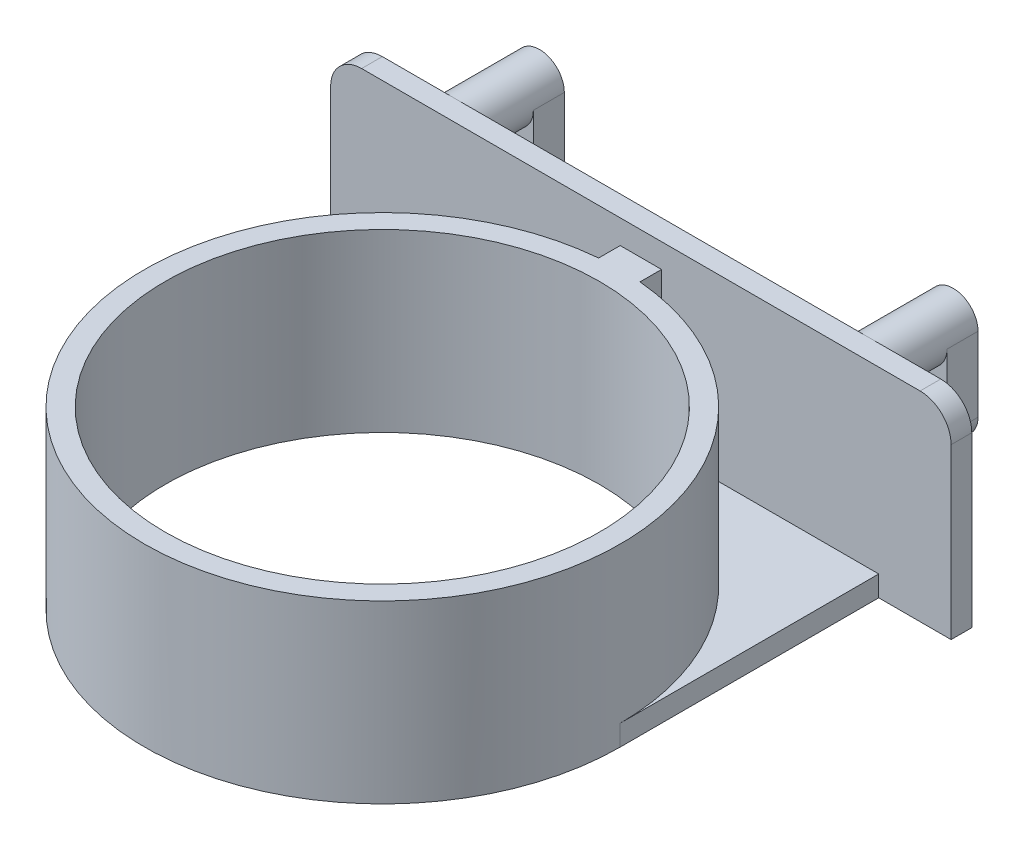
ISO-10303-21;
HEADER;
FILE_DESCRIPTION(('STEP AP214'),'2;1');
FILE_NAME('part.step','',(''),(''),'','','');
FILE_SCHEMA(('AUTOMOTIVE_DESIGN { 1 0 10303 214 1 1 1 1 }'));
ENDSEC;
DATA;
#1=APPLICATION_CONTEXT('core data for automotive mechanical design processes');
#2=APPLICATION_PROTOCOL_DEFINITION('international standard','automotive_design',2000,#1);
#3=PRODUCT_CONTEXT('',#1,'mechanical');
#4=PRODUCT('Part','Part','',(#3));
#5=PRODUCT_RELATED_PRODUCT_CATEGORY('part','',(#4));
#6=PRODUCT_DEFINITION_FORMATION('','',#4);
#7=PRODUCT_DEFINITION_CONTEXT('part definition',#1,'design');
#8=PRODUCT_DEFINITION('design','',#6,#7);
#9=PRODUCT_DEFINITION_SHAPE('','',#8);
#10=(LENGTH_UNIT() NAMED_UNIT(*) SI_UNIT(.MILLI.,.METRE.));
#11=(NAMED_UNIT(*) PLANE_ANGLE_UNIT() SI_UNIT($,.RADIAN.));
#12=(NAMED_UNIT(*) SI_UNIT($,.STERADIAN.) SOLID_ANGLE_UNIT());
#13=UNCERTAINTY_MEASURE_WITH_UNIT(LENGTH_MEASURE(1.E-05),#10,'distance_accuracy_value','');
#14=(GEOMETRIC_REPRESENTATION_CONTEXT(3) GLOBAL_UNCERTAINTY_ASSIGNED_CONTEXT((#13)) GLOBAL_UNIT_ASSIGNED_CONTEXT((#10,
#11,#12)) REPRESENTATION_CONTEXT('',''));
#15=CARTESIAN_POINT('',(0.,0.,0.));
#16=DIRECTION('',(0.,0.,1.));
#17=DIRECTION('',(1.,0.,0.));
#18=AXIS2_PLACEMENT_3D('',#15,#16,#17);
#19=CARTESIAN_POINT('',(0.,0.,0.));
#20=DIRECTION('',(0.,-1.,0.));
#21=DIRECTION('',(0.,0.,-1.));
#22=AXIS2_PLACEMENT_3D('',#19,#20,#21);
#23=PLANE('',#22);
#24=CARTESIAN_POINT('',(0.,0.,0.));
#25=DIRECTION('',(0.,1.,0.));
#26=DIRECTION('',(0.,0.,1.));
#27=AXIS2_PLACEMENT_3D('',#24,#25,#26);
#28=CIRCLE('',#27,23.);
#29=CARTESIAN_POINT('',(-2.,0.,-22.9128784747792));
#30=VERTEX_POINT('',#29);
#31=CARTESIAN_POINT('',(-23.,0.,0.));
#32=VERTEX_POINT('',#31);
#33=EDGE_CURVE('E360',#30,#32,#28,.T.);
#34=ORIENTED_EDGE('',*,*,#33,.F.);
#35=DIRECTION('',(0.,0.,1.));
#36=VECTOR('',#35,1.);
#37=CARTESIAN_POINT('',(-2.,0.,-21.8));
#38=LINE('',#37,#36);
#39=CARTESIAN_POINT('',(-2.,0.,-25.));
#40=VERTEX_POINT('',#39);
#41=EDGE_CURVE('E269',#40,#30,#38,.T.);
#42=ORIENTED_EDGE('',*,*,#41,.F.);
#43=DIRECTION('',(1.,0.,0.));
#44=VECTOR('',#43,1.);
#45=CARTESIAN_POINT('',(23.,0.,-25.));
#46=LINE('',#45,#44);
#47=CARTESIAN_POINT('',(-23.,0.,-25.));
#48=VERTEX_POINT('',#47);
#49=EDGE_CURVE('E342',#48,#40,#46,.T.);
#50=ORIENTED_EDGE('',*,*,#49,.F.);
#51=DIRECTION('',(0.,0.,-1.));
#52=VECTOR('',#51,1.);
#53=CARTESIAN_POINT('',(-23.,0.,0.));
#54=LINE('',#53,#52);
#55=EDGE_CURVE('E329',#32,#48,#54,.T.);
#56=ORIENTED_EDGE('',*,*,#55,.F.);
#57=EDGE_LOOP('',(#34,#42,#50,#56));
#58=FACE_BOUND('',#57,.T.);
#59=ADVANCED_FACE('F33',(#58),#23,.F.);
#60=CARTESIAN_POINT('',(0.,15.,0.));
#61=DIRECTION('',(0.,1.,0.));
#62=DIRECTION('',(0.,0.,1.));
#63=AXIS2_PLACEMENT_3D('',#60,#61,#62);
#64=PLANE('',#63);
#65=DIRECTION('',(0.,0.,1.));
#66=VECTOR('',#65,1.);
#67=CARTESIAN_POINT('',(-2.,15.,-21.8));
#68=LINE('',#67,#66);
#69=CARTESIAN_POINT('',(-2.,15.,-25.));
#70=VERTEX_POINT('',#69);
#71=CARTESIAN_POINT('',(-2.,15.,-22.9128784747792));
#72=VERTEX_POINT('',#71);
#73=EDGE_CURVE('E263',#70,#72,#68,.T.);
#74=ORIENTED_EDGE('',*,*,#73,.T.);
#75=CARTESIAN_POINT('',(0.,15.,0.));
#76=DIRECTION('',(0.,1.,0.));
#77=DIRECTION('',(0.,0.,1.));
#78=AXIS2_PLACEMENT_3D('',#75,#76,#77);
#79=CIRCLE('',#78,23.);
#80=CARTESIAN_POINT('',(2.,15.,-22.9128784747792));
#81=VERTEX_POINT('',#80);
#82=EDGE_CURVE('E361',#72,#81,#79,.T.);
#83=ORIENTED_EDGE('',*,*,#82,.T.);
#84=DIRECTION('',(0.,0.,-1.));
#85=VECTOR('',#84,1.);
#86=CARTESIAN_POINT('',(2.,15.,-21.8));
#87=LINE('',#86,#85);
#88=CARTESIAN_POINT('',(2.,15.,-25.));
#89=VERTEX_POINT('',#88);
#90=EDGE_CURVE('E266',#81,#89,#87,.T.);
#91=ORIENTED_EDGE('',*,*,#90,.T.);
#92=DIRECTION('',(1.,0.,0.));
#93=VECTOR('',#92,1.);
#94=CARTESIAN_POINT('',(-27.,15.,-25.));
#95=LINE('',#94,#93);
#96=EDGE_CURVE('E41',#70,#89,#95,.T.);
#97=ORIENTED_EDGE('',*,*,#96,.F.);
#98=EDGE_LOOP('',(#74,#83,#91,#97));
#99=FACE_BOUND('',#98,.T.);
#100=CARTESIAN_POINT('',(0.,15.,0.));
#101=DIRECTION('',(0.,1.,0.));
#102=DIRECTION('',(0.,0.,1.));
#103=AXIS2_PLACEMENT_3D('',#100,#101,#102);
#104=CIRCLE('',#103,21.);
#105=CARTESIAN_POINT('',(0.,15.,21.));
#106=VERTEX_POINT('',#105);
#107=EDGE_CURVE('E357',#106,#106,#104,.T.);
#108=ORIENTED_EDGE('',*,*,#107,.F.);
#109=EDGE_LOOP('',(#108));
#110=FACE_BOUND('',#109,.T.);
#111=ADVANCED_FACE('F375',(#99,#110),#64,.T.);
#112=CARTESIAN_POINT('',(0.,15.,0.));
#113=DIRECTION('',(0.,-1.,0.));
#114=DIRECTION('',(0.,0.,-1.));
#115=AXIS2_PLACEMENT_3D('',#112,#113,#114);
#116=CYLINDRICAL_SURFACE('',#115,23.);
#117=ORIENTED_EDGE('',*,*,#82,.F.);
#118=DIRECTION('',(0.,-1.,0.));
#119=VECTOR('',#118,1.);
#120=CARTESIAN_POINT('',(-2.,15.,-22.9128784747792));
#121=LINE('',#120,#119);
#122=EDGE_CURVE('E278',#72,#30,#121,.T.);
#123=ORIENTED_EDGE('',*,*,#122,.T.);
#124=ORIENTED_EDGE('',*,*,#33,.T.);
#125=DIRECTION('',(0.,1.,0.));
#126=VECTOR('',#125,1.);
#127=CARTESIAN_POINT('',(-23.,-2.,0.));
#128=LINE('',#127,#126);
#129=CARTESIAN_POINT('',(-23.,-2.,0.));
#130=VERTEX_POINT('',#129);
#131=EDGE_CURVE('E354',#130,#32,#128,.T.);
#132=ORIENTED_EDGE('',*,*,#131,.F.);
#133=CARTESIAN_POINT('',(0.,-2.,0.));
#134=DIRECTION('',(0.,-1.,0.));
#135=DIRECTION('',(0.,0.,-1.));
#136=AXIS2_PLACEMENT_3D('',#133,#134,#135);
#137=CIRCLE('',#136,23.);
#138=CARTESIAN_POINT('',(23.,-2.,0.));
#139=VERTEX_POINT('',#138);
#140=EDGE_CURVE('E330',#139,#130,#137,.T.);
#141=ORIENTED_EDGE('',*,*,#140,.F.);
#142=DIRECTION('',(0.,1.,0.));
#143=VECTOR('',#142,1.);
#144=CARTESIAN_POINT('',(23.,-2.,0.));
#145=LINE('',#144,#143);
#146=CARTESIAN_POINT('',(23.,0.,0.));
#147=VERTEX_POINT('',#146);
#148=EDGE_CURVE('E338',#139,#147,#145,.T.);
#149=ORIENTED_EDGE('',*,*,#148,.T.);
#150=CARTESIAN_POINT('',(2.,0.,-22.9128784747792));
#151=VERTEX_POINT('',#150);
#152=EDGE_CURVE('E365',#147,#151,#28,.T.);
#153=ORIENTED_EDGE('',*,*,#152,.T.);
#154=DIRECTION('',(0.,-1.,0.));
#155=VECTOR('',#154,1.);
#156=CARTESIAN_POINT('',(2.,15.,-22.9128784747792));
#157=LINE('',#156,#155);
#158=EDGE_CURVE('E275',#151,#81,#157,.F.);
#159=ORIENTED_EDGE('',*,*,#158,.T.);
#160=EDGE_LOOP('',(#117,#123,#124,#132,#141,#149,#153,#159));
#161=FACE_BOUND('',#160,.T.);
#162=ADVANCED_FACE('F35',(#161),#116,.T.);
#163=CARTESIAN_POINT('',(0.,15.,0.));
#164=DIRECTION('',(0.,-1.,0.));
#165=DIRECTION('',(0.,0.,-1.));
#166=AXIS2_PLACEMENT_3D('',#163,#164,#165);
#167=CYLINDRICAL_SURFACE('',#166,21.);
#168=ORIENTED_EDGE('',*,*,#107,.T.);
#169=EDGE_LOOP('',(#168));
#170=FACE_BOUND('',#169,.T.);
#171=CARTESIAN_POINT('',(0.,-2.,0.));
#172=DIRECTION('',(0.,-1.,0.));
#173=DIRECTION('',(0.,0.,-1.));
#174=AXIS2_PLACEMENT_3D('',#171,#172,#173);
#175=CIRCLE('',#174,21.);
#176=CARTESIAN_POINT('',(0.,-2.,-21.));
#177=VERTEX_POINT('',#176);
#178=EDGE_CURVE('E223',#177,#177,#175,.F.);
#179=ORIENTED_EDGE('',*,*,#178,.F.);
#180=EDGE_LOOP('',(#179));
#181=FACE_BOUND('',#180,.T.);
#182=ADVANCED_FACE('F596',(#170,#181),#167,.F.);
#183=CARTESIAN_POINT('',(-23.,-2.,0.));
#184=DIRECTION('',(1.,0.,0.));
#185=DIRECTION('',(0.,0.,-1.));
#186=AXIS2_PLACEMENT_3D('',#183,#184,#185);
#187=PLANE('',#186);
#188=ORIENTED_EDGE('',*,*,#55,.T.);
#189=DIRECTION('',(0.,1.,0.));
#190=VECTOR('',#189,1.);
#191=CARTESIAN_POINT('',(-23.,-2.,-25.));
#192=LINE('',#191,#190);
#193=CARTESIAN_POINT('',(-23.,-2.,-25.));
#194=VERTEX_POINT('',#193);
#195=EDGE_CURVE('E351',#194,#48,#192,.T.);
#196=ORIENTED_EDGE('',*,*,#195,.F.);
#197=DIRECTION('',(0.,0.,-1.));
#198=VECTOR('',#197,1.);
#199=CARTESIAN_POINT('',(-23.,-2.,0.));
#200=LINE('',#199,#198);
#201=EDGE_CURVE('E333',#130,#194,#200,.T.);
#202=ORIENTED_EDGE('',*,*,#201,.F.);
#203=ORIENTED_EDGE('',*,*,#131,.T.);
#204=EDGE_LOOP('',(#188,#196,#202,#203));
#205=FACE_BOUND('',#204,.T.);
#206=ADVANCED_FACE('F388',(#205),#187,.F.);
#207=CARTESIAN_POINT('',(23.,-2.,0.));
#208=DIRECTION('',(-1.,0.,0.));
#209=DIRECTION('',(0.,0.,1.));
#210=AXIS2_PLACEMENT_3D('',#207,#208,#209);
#211=PLANE('',#210);
#212=DIRECTION('',(0.,0.,1.));
#213=VECTOR('',#212,1.);
#214=CARTESIAN_POINT('',(23.,0.,0.));
#215=LINE('',#214,#213);
#216=CARTESIAN_POINT('',(23.,0.,-25.));
#217=VERTEX_POINT('',#216);
#218=EDGE_CURVE('E334',#217,#147,#215,.T.);
#219=ORIENTED_EDGE('',*,*,#218,.T.);
#220=ORIENTED_EDGE('',*,*,#148,.F.);
#221=DIRECTION('',(0.,0.,1.));
#222=VECTOR('',#221,1.);
#223=CARTESIAN_POINT('',(23.,-2.,0.));
#224=LINE('',#223,#222);
#225=CARTESIAN_POINT('',(23.,-2.,-25.));
#226=VERTEX_POINT('',#225);
#227=EDGE_CURVE('E336',#226,#139,#224,.T.);
#228=ORIENTED_EDGE('',*,*,#227,.F.);
#229=DIRECTION('',(0.,1.,0.));
#230=VECTOR('',#229,1.);
#231=CARTESIAN_POINT('',(23.,-2.,-25.));
#232=LINE('',#231,#230);
#233=EDGE_CURVE('E348',#226,#217,#232,.T.);
#234=ORIENTED_EDGE('',*,*,#233,.T.);
#235=EDGE_LOOP('',(#219,#220,#228,#234));
#236=FACE_BOUND('',#235,.T.);
#237=ADVANCED_FACE('F396',(#236),#211,.F.);
#238=CARTESIAN_POINT('',(0.,-2.,0.));
#239=DIRECTION('',(0.,-1.,0.));
#240=DIRECTION('',(0.,0.,-1.));
#241=AXIS2_PLACEMENT_3D('',#238,#239,#240);
#242=PLANE('',#241);
#243=ORIENTED_EDGE('',*,*,#178,.T.);
#244=EDGE_LOOP('',(#243));
#245=FACE_BOUND('',#244,.T.);
#246=ORIENTED_EDGE('',*,*,#140,.T.);
#247=ORIENTED_EDGE('',*,*,#201,.T.);
#248=DIRECTION('',(-1.,0.,0.));
#249=VECTOR('',#248,1.);
#250=CARTESIAN_POINT('',(30.,-1.99999999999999,-25.));
#251=LINE('',#250,#249);
#252=CARTESIAN_POINT('',(-30.,-1.99999999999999,-25.));
#253=VERTEX_POINT('',#252);
#254=EDGE_CURVE('E307',#194,#253,#251,.T.);
#255=ORIENTED_EDGE('',*,*,#254,.T.);
#256=DIRECTION('',(0.,0.,1.));
#257=VECTOR('',#256,1.);
#258=CARTESIAN_POINT('',(-30.,-1.99999999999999,-27.));
#259=LINE('',#258,#257);
#260=CARTESIAN_POINT('',(-30.,-1.99999999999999,-27.));
#261=VERTEX_POINT('',#260);
#262=EDGE_CURVE('E314',#261,#253,#259,.T.);
#263=ORIENTED_EDGE('',*,*,#262,.F.);
#264=DIRECTION('',(-1.,0.,0.));
#265=VECTOR('',#264,1.);
#266=CARTESIAN_POINT('',(30.,-1.99999999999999,-27.));
#267=LINE('',#266,#265);
#268=CARTESIAN_POINT('',(30.,-1.99999999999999,-27.));
#269=VERTEX_POINT('',#268);
#270=EDGE_CURVE('E294',#269,#261,#267,.T.);
#271=ORIENTED_EDGE('',*,*,#270,.F.);
#272=DIRECTION('',(0.,0.,1.));
#273=VECTOR('',#272,1.);
#274=CARTESIAN_POINT('',(30.,-1.99999999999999,-27.));
#275=LINE('',#274,#273);
#276=CARTESIAN_POINT('',(30.,-1.99999999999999,-25.));
#277=VERTEX_POINT('',#276);
#278=EDGE_CURVE('E317',#269,#277,#275,.T.);
#279=ORIENTED_EDGE('',*,*,#278,.T.);
#280=EDGE_CURVE('E308',#277,#226,#251,.T.);
#281=ORIENTED_EDGE('',*,*,#280,.T.);
#282=ORIENTED_EDGE('',*,*,#227,.T.);
#283=EDGE_LOOP('',(#246,#247,#255,#263,#271,#279,#281,#282));
#284=FACE_BOUND('',#283,.T.);
#285=ADVANCED_FACE('F392',(#245,#284),#242,.T.);
#286=CARTESIAN_POINT('',(2.,0.,-25.));
#287=VERTEX_POINT('',#286);
#288=EDGE_CURVE('E341',#287,#217,#46,.T.);
#289=ORIENTED_EDGE('',*,*,#288,.F.);
#290=DIRECTION('',(0.,0.,-1.));
#291=VECTOR('',#290,1.);
#292=CARTESIAN_POINT('',(2.,0.,-21.8));
#293=LINE('',#292,#291);
#294=EDGE_CURVE('E273',#151,#287,#293,.T.);
#295=ORIENTED_EDGE('',*,*,#294,.F.);
#296=ORIENTED_EDGE('',*,*,#152,.F.);
#297=ORIENTED_EDGE('',*,*,#218,.F.);
#298=EDGE_LOOP('',(#289,#295,#296,#297));
#299=FACE_BOUND('',#298,.T.);
#300=ADVANCED_FACE('F401',(#299),#23,.F.);
#301=CARTESIAN_POINT('',(-27.,14.3250882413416,-27.));
#302=DIRECTION('',(0.,0.,1.));
#303=DIRECTION('',(1.,0.,0.));
#304=AXIS2_PLACEMENT_3D('',#301,#302,#303);
#305=CYLINDRICAL_SURFACE('',#304,3.);
#306=CARTESIAN_POINT('',(-27.,14.3250882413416,-25.));
#307=DIRECTION('',(0.,0.,-1.));
#308=DIRECTION('',(-1.,0.,0.));
#309=AXIS2_PLACEMENT_3D('',#306,#307,#308);
#310=CIRCLE('',#309,3.);
#311=CARTESIAN_POINT('',(-30.,14.3250882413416,-25.));
#312=VERTEX_POINT('',#311);
#313=CARTESIAN_POINT('',(-27.,17.3250882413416,-25.));
#314=VERTEX_POINT('',#313);
#315=EDGE_CURVE('E281',#312,#314,#310,.T.);
#316=ORIENTED_EDGE('',*,*,#315,.T.);
#317=DIRECTION('',(0.,0.,1.));
#318=VECTOR('',#317,1.);
#319=CARTESIAN_POINT('',(-27.,17.3250882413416,-27.));
#320=LINE('',#319,#318);
#321=CARTESIAN_POINT('',(-27.,17.3250882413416,-27.));
#322=VERTEX_POINT('',#321);
#323=EDGE_CURVE('E326',#322,#314,#320,.T.);
#324=ORIENTED_EDGE('',*,*,#323,.F.);
#325=CARTESIAN_POINT('',(-27.,14.3250882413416,-27.));
#326=DIRECTION('',(0.,0.,-1.));
#327=DIRECTION('',(-1.,0.,0.));
#328=AXIS2_PLACEMENT_3D('',#325,#326,#327);
#329=CIRCLE('',#328,3.);
#330=CARTESIAN_POINT('',(-30.,14.3250882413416,-27.));
#331=VERTEX_POINT('',#330);
#332=EDGE_CURVE('E282',#331,#322,#329,.T.);
#333=ORIENTED_EDGE('',*,*,#332,.F.);
#334=DIRECTION('',(0.,0.,1.));
#335=VECTOR('',#334,1.);
#336=CARTESIAN_POINT('',(-30.,14.3250882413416,-27.));
#337=LINE('',#336,#335);
#338=EDGE_CURVE('E298',#331,#312,#337,.T.);
#339=ORIENTED_EDGE('',*,*,#338,.T.);
#340=EDGE_LOOP('',(#316,#324,#333,#339));
#341=FACE_BOUND('',#340,.T.);
#342=ADVANCED_FACE('F422',(#341),#305,.T.);
#343=CARTESIAN_POINT('',(-27.,17.3250882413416,-27.));
#344=DIRECTION('',(0.,-1.,0.));
#345=DIRECTION('',(1.,0.,0.));
#346=AXIS2_PLACEMENT_3D('',#343,#344,#345);
#347=PLANE('',#346);
#348=DIRECTION('',(1.,0.,0.));
#349=VECTOR('',#348,1.);
#350=CARTESIAN_POINT('',(-27.,17.3250882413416,-25.));
#351=LINE('',#350,#349);
#352=CARTESIAN_POINT('',(27.,17.3250882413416,-25.));
#353=VERTEX_POINT('',#352);
#354=EDGE_CURVE('E301',#314,#353,#351,.T.);
#355=ORIENTED_EDGE('',*,*,#354,.T.);
#356=DIRECTION('',(0.,0.,1.));
#357=VECTOR('',#356,1.);
#358=CARTESIAN_POINT('',(27.,17.3250882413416,-27.));
#359=LINE('',#358,#357);
#360=CARTESIAN_POINT('',(27.,17.3250882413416,-27.));
#361=VERTEX_POINT('',#360);
#362=EDGE_CURVE('E323',#361,#353,#359,.T.);
#363=ORIENTED_EDGE('',*,*,#362,.F.);
#364=DIRECTION('',(1.,0.,0.));
#365=VECTOR('',#364,1.);
#366=CARTESIAN_POINT('',(-27.,17.3250882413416,-27.));
#367=LINE('',#366,#365);
#368=CARTESIAN_POINT('',(20.,17.3250882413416,-27.));
#369=VERTEX_POINT('',#368);
#370=EDGE_CURVE('E285',#369,#361,#367,.T.);
#371=ORIENTED_EDGE('',*,*,#370,.F.);
#372=CARTESIAN_POINT('',(-20.,17.3250882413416,-27.));
#373=VERTEX_POINT('',#372);
#374=EDGE_CURVE('E290',#373,#369,#367,.T.);
#375=ORIENTED_EDGE('',*,*,#374,.F.);
#376=EDGE_CURVE('E287',#322,#373,#367,.T.);
#377=ORIENTED_EDGE('',*,*,#376,.F.);
#378=ORIENTED_EDGE('',*,*,#323,.T.);
#379=EDGE_LOOP('',(#355,#363,#371,#375,#377,#378));
#380=FACE_BOUND('',#379,.T.);
#381=ADVANCED_FACE('F427',(#380),#347,.F.);
#382=CARTESIAN_POINT('',(27.,14.3250882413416,-27.));
#383=DIRECTION('',(0.,0.,1.));
#384=DIRECTION('',(1.,0.,0.));
#385=AXIS2_PLACEMENT_3D('',#382,#383,#384);
#386=CYLINDRICAL_SURFACE('',#385,3.);
#387=CARTESIAN_POINT('',(27.,14.3250882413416,-25.));
#388=DIRECTION('',(0.,0.,-1.));
#389=DIRECTION('',(-1.,0.,0.));
#390=AXIS2_PLACEMENT_3D('',#387,#388,#389);
#391=CIRCLE('',#390,3.);
#392=CARTESIAN_POINT('',(30.,14.3250882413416,-25.));
#393=VERTEX_POINT('',#392);
#394=EDGE_CURVE('E303',#353,#393,#391,.T.);
#395=ORIENTED_EDGE('',*,*,#394,.T.);
#396=DIRECTION('',(0.,0.,1.));
#397=VECTOR('',#396,1.);
#398=CARTESIAN_POINT('',(30.,14.3250882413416,-27.));
#399=LINE('',#398,#397);
#400=CARTESIAN_POINT('',(30.,14.3250882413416,-27.));
#401=VERTEX_POINT('',#400);
#402=EDGE_CURVE('E320',#401,#393,#399,.T.);
#403=ORIENTED_EDGE('',*,*,#402,.F.);
#404=CARTESIAN_POINT('',(27.,14.3250882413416,-27.));
#405=DIRECTION('',(0.,0.,-1.));
#406=DIRECTION('',(-1.,0.,0.));
#407=AXIS2_PLACEMENT_3D('',#404,#405,#406);
#408=CIRCLE('',#407,3.);
#409=EDGE_CURVE('E289',#361,#401,#408,.T.);
#410=ORIENTED_EDGE('',*,*,#409,.F.);
#411=ORIENTED_EDGE('',*,*,#362,.T.);
#412=EDGE_LOOP('',(#395,#403,#410,#411));
#413=FACE_BOUND('',#412,.T.);
#414=ADVANCED_FACE('F438',(#413),#386,.T.);
#415=CARTESIAN_POINT('',(30.,-1.99999999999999,-27.));
#416=DIRECTION('',(-1.,0.,0.));
#417=DIRECTION('',(0.,0.,1.));
#418=AXIS2_PLACEMENT_3D('',#415,#416,#417);
#419=PLANE('',#418);
#420=DIRECTION('',(0.,-1.,0.));
#421=VECTOR('',#420,1.);
#422=CARTESIAN_POINT('',(30.,-1.99999999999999,-25.));
#423=LINE('',#422,#421);
#424=EDGE_CURVE('E305',#393,#277,#423,.T.);
#425=ORIENTED_EDGE('',*,*,#424,.T.);
#426=ORIENTED_EDGE('',*,*,#278,.F.);
#427=DIRECTION('',(0.,-1.,0.));
#428=VECTOR('',#427,1.);
#429=CARTESIAN_POINT('',(30.,-1.99999999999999,-27.));
#430=LINE('',#429,#428);
#431=EDGE_CURVE('E292',#401,#269,#430,.T.);
#432=ORIENTED_EDGE('',*,*,#431,.F.);
#433=ORIENTED_EDGE('',*,*,#402,.T.);
#434=EDGE_LOOP('',(#425,#426,#432,#433));
#435=FACE_BOUND('',#434,.T.);
#436=ADVANCED_FACE('F442',(#435),#419,.F.);
#437=CARTESIAN_POINT('',(-30.,-1.99999999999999,-27.));
#438=DIRECTION('',(1.,0.,0.));
#439=DIRECTION('',(0.,0.,-1.));
#440=AXIS2_PLACEMENT_3D('',#437,#438,#439);
#441=PLANE('',#440);
#442=DIRECTION('',(0.,1.,0.));
#443=VECTOR('',#442,1.);
#444=CARTESIAN_POINT('',(-30.,-1.99999999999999,-25.));
#445=LINE('',#444,#443);
#446=EDGE_CURVE('E286',#253,#312,#445,.T.);
#447=ORIENTED_EDGE('',*,*,#446,.T.);
#448=ORIENTED_EDGE('',*,*,#338,.F.);
#449=DIRECTION('',(0.,1.,0.));
#450=VECTOR('',#449,1.);
#451=CARTESIAN_POINT('',(-30.,-1.99999999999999,-27.));
#452=LINE('',#451,#450);
#453=EDGE_CURVE('E296',#261,#331,#452,.T.);
#454=ORIENTED_EDGE('',*,*,#453,.F.);
#455=ORIENTED_EDGE('',*,*,#262,.T.);
#456=EDGE_LOOP('',(#447,#448,#454,#455));
#457=FACE_BOUND('',#456,.T.);
#458=ADVANCED_FACE('F446',(#457),#441,.F.);
#459=CARTESIAN_POINT('',(-27.,14.3250882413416,-27.));
#460=DIRECTION('',(0.,0.,-1.));
#461=DIRECTION('',(-1.,0.,0.));
#462=AXIS2_PLACEMENT_3D('',#459,#460,#461);
#463=PLANE('',#462);
#464=ORIENTED_EDGE('',*,*,#376,.T.);
#465=CARTESIAN_POINT('',(-20.,14.9250882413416,-27.));
#466=DIRECTION('',(0.,0.,1.));
#467=DIRECTION('',(1.,0.,0.));
#468=AXIS2_PLACEMENT_3D('',#465,#466,#467);
#469=CIRCLE('',#468,2.4);
#470=EDGE_CURVE('E200',#373,#373,#469,.T.);
#471=ORIENTED_EDGE('',*,*,#470,.T.);
#472=ORIENTED_EDGE('',*,*,#374,.T.);
#473=CARTESIAN_POINT('',(20.,14.9250882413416,-27.));
#474=DIRECTION('',(0.,0.,-1.));
#475=DIRECTION('',(-1.,0.,0.));
#476=AXIS2_PLACEMENT_3D('',#473,#474,#475);
#477=CIRCLE('',#476,2.4);
#478=EDGE_CURVE('E261',#369,#369,#477,.T.);
#479=ORIENTED_EDGE('',*,*,#478,.F.);
#480=ORIENTED_EDGE('',*,*,#370,.T.);
#481=ORIENTED_EDGE('',*,*,#409,.T.);
#482=ORIENTED_EDGE('',*,*,#431,.T.);
#483=ORIENTED_EDGE('',*,*,#270,.T.);
#484=ORIENTED_EDGE('',*,*,#453,.T.);
#485=ORIENTED_EDGE('',*,*,#332,.T.);
#486=EDGE_LOOP('',(#464,#471,#472,#479,#480,#481,#482,#483,#484,#485));
#487=FACE_BOUND('',#486,.T.);
#488=ADVANCED_FACE('F450',(#487),#463,.T.);
#489=CARTESIAN_POINT('',(-27.,14.3250882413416,-25.));
#490=DIRECTION('',(0.,0.,-1.));
#491=DIRECTION('',(-1.,0.,0.));
#492=AXIS2_PLACEMENT_3D('',#489,#490,#491);
#493=PLANE('',#492);
#494=ORIENTED_EDGE('',*,*,#49,.T.);
#495=DIRECTION('',(0.,1.,0.));
#496=VECTOR('',#495,1.);
#497=CARTESIAN_POINT('',(-2.,14.3250882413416,-25.));
#498=LINE('',#497,#496);
#499=EDGE_CURVE('E11',#40,#70,#498,.T.);
#500=ORIENTED_EDGE('',*,*,#499,.T.);
#501=ORIENTED_EDGE('',*,*,#96,.T.);
#502=DIRECTION('',(0.,-1.,0.));
#503=VECTOR('',#502,1.);
#504=CARTESIAN_POINT('',(2.,14.3250882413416,-25.));
#505=LINE('',#504,#503);
#506=EDGE_CURVE('E364',#89,#287,#505,.T.);
#507=ORIENTED_EDGE('',*,*,#506,.T.);
#508=ORIENTED_EDGE('',*,*,#288,.T.);
#509=ORIENTED_EDGE('',*,*,#233,.F.);
#510=ORIENTED_EDGE('',*,*,#280,.F.);
#511=ORIENTED_EDGE('',*,*,#424,.F.);
#512=ORIENTED_EDGE('',*,*,#394,.F.);
#513=ORIENTED_EDGE('',*,*,#354,.F.);
#514=ORIENTED_EDGE('',*,*,#315,.F.);
#515=ORIENTED_EDGE('',*,*,#446,.F.);
#516=ORIENTED_EDGE('',*,*,#254,.F.);
#517=ORIENTED_EDGE('',*,*,#195,.T.);
#518=EDGE_LOOP('',(#494,#500,#501,#507,#508,#509,#510,#511,#512,#513,#514,#515,#516,#517));
#519=FACE_BOUND('',#518,.T.);
#520=ADVANCED_FACE('F371',(#519),#493,.F.);
#521=CARTESIAN_POINT('',(-2.,-6.40312423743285,-21.8));
#522=DIRECTION('',(-1.,0.,0.));
#523=DIRECTION('',(0.,0.,1.));
#524=AXIS2_PLACEMENT_3D('',#521,#522,#523);
#525=PLANE('',#524);
#526=ORIENTED_EDGE('',*,*,#122,.F.);
#527=ORIENTED_EDGE('',*,*,#73,.F.);
#528=ORIENTED_EDGE('',*,*,#499,.F.);
#529=ORIENTED_EDGE('',*,*,#41,.T.);
#530=EDGE_LOOP('',(#526,#527,#528,#529));
#531=FACE_BOUND('',#530,.T.);
#532=ADVANCED_FACE('F379',(#531),#525,.T.);
#533=CARTESIAN_POINT('',(2.,-6.40312423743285,-21.8));
#534=DIRECTION('',(1.,0.,0.));
#535=DIRECTION('',(0.,0.,-1.));
#536=AXIS2_PLACEMENT_3D('',#533,#534,#535);
#537=PLANE('',#536);
#538=ORIENTED_EDGE('',*,*,#158,.F.);
#539=ORIENTED_EDGE('',*,*,#294,.T.);
#540=ORIENTED_EDGE('',*,*,#506,.F.);
#541=ORIENTED_EDGE('',*,*,#90,.F.);
#542=EDGE_LOOP('',(#538,#539,#540,#541));
#543=FACE_BOUND('',#542,.T.);
#544=ADVANCED_FACE('F403',(#543),#537,.T.);
#545=CARTESIAN_POINT('',(20.,14.9250882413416,-32.2));
#546=DIRECTION('',(0.,0.,1.));
#547=DIRECTION('',(1.,0.,0.));
#548=AXIS2_PLACEMENT_3D('',#545,#546,#547);
#549=CYLINDRICAL_SURFACE('',#548,2.4);
#550=CARTESIAN_POINT('',(20.,14.9250882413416,-32.2));
#551=DIRECTION('',(0.,0.,-1.));
#552=DIRECTION('',(-1.,0.,0.));
#553=AXIS2_PLACEMENT_3D('',#550,#551,#552);
#554=CIRCLE('',#553,2.4);
#555=CARTESIAN_POINT('',(22.4,14.9250882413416,-32.2));
#556=VERTEX_POINT('',#555);
#557=CARTESIAN_POINT('',(17.6,14.9250882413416,-32.2));
#558=VERTEX_POINT('',#557);
#559=EDGE_CURVE('E56',#556,#558,#554,.T.);
#560=ORIENTED_EDGE('',*,*,#559,.F.);
#561=DIRECTION('',(0.,0.,1.));
#562=VECTOR('',#561,1.);
#563=CARTESIAN_POINT('',(22.4,14.9250882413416,-35.2));
#564=LINE('',#563,#562);
#565=CARTESIAN_POINT('',(22.4,14.9250882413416,-35.2));
#566=VERTEX_POINT('',#565);
#567=EDGE_CURVE('E258',#566,#556,#564,.T.);
#568=ORIENTED_EDGE('',*,*,#567,.F.);
#569=CARTESIAN_POINT('',(20.,14.9250882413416,-35.2));
#570=DIRECTION('',(0.,0.,-1.));
#571=DIRECTION('',(-1.,0.,0.));
#572=AXIS2_PLACEMENT_3D('',#569,#570,#571);
#573=CIRCLE('',#572,2.4);
#574=CARTESIAN_POINT('',(17.6,14.9250882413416,-35.2));
#575=VERTEX_POINT('',#574);
#576=EDGE_CURVE('E235',#575,#566,#573,.T.);
#577=ORIENTED_EDGE('',*,*,#576,.F.);
#578=DIRECTION('',(0.,0.,1.));
#579=VECTOR('',#578,1.);
#580=CARTESIAN_POINT('',(17.6,14.9250882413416,-35.2));
#581=LINE('',#580,#579);
#582=EDGE_CURVE('E245',#575,#558,#581,.T.);
#583=ORIENTED_EDGE('',*,*,#582,.T.);
#584=EDGE_LOOP('',(#560,#568,#577,#583));
#585=FACE_BOUND('',#584,.T.);
#586=ORIENTED_EDGE('',*,*,#478,.T.);
#587=EDGE_LOOP('',(#586));
#588=FACE_BOUND('',#587,.T.);
#589=ADVANCED_FACE('F405',(#585,#588),#549,.T.);
#590=CARTESIAN_POINT('',(20.,14.9250882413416,-32.2));
#591=DIRECTION('',(0.,0.,-1.));
#592=DIRECTION('',(-1.,0.,0.));
#593=AXIS2_PLACEMENT_3D('',#590,#591,#592);
#594=PLANE('',#593);
#595=DIRECTION('',(0.,-1.,0.));
#596=VECTOR('',#595,1.);
#597=CARTESIAN_POINT('',(22.4,14.9250882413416,-32.2));
#598=LINE('',#597,#596);
#599=CARTESIAN_POINT('',(22.4,7.72508824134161,-32.2));
#600=VERTEX_POINT('',#599);
#601=EDGE_CURVE('E232',#556,#600,#598,.T.);
#602=ORIENTED_EDGE('',*,*,#601,.F.);
#603=ORIENTED_EDGE('',*,*,#559,.T.);
#604=DIRECTION('',(0.,1.,0.));
#605=VECTOR('',#604,1.);
#606=CARTESIAN_POINT('',(17.6,14.9250882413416,-32.2));
#607=LINE('',#606,#605);
#608=CARTESIAN_POINT('',(17.6,7.72508824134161,-32.2));
#609=VERTEX_POINT('',#608);
#610=EDGE_CURVE('E239',#609,#558,#607,.T.);
#611=ORIENTED_EDGE('',*,*,#610,.F.);
#612=CARTESIAN_POINT('',(20.,7.72508824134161,-32.2));
#613=DIRECTION('',(0.,0.,-1.));
#614=DIRECTION('',(-1.,0.,0.));
#615=AXIS2_PLACEMENT_3D('',#612,#613,#614);
#616=CIRCLE('',#615,2.39999999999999);
#617=EDGE_CURVE('E247',#600,#609,#616,.T.);
#618=ORIENTED_EDGE('',*,*,#617,.F.);
#619=EDGE_LOOP('',(#602,#603,#611,#618));
#620=FACE_BOUND('',#619,.T.);
#621=ADVANCED_FACE('F411',(#620),#594,.F.);
#622=CARTESIAN_POINT('',(22.4,14.9250882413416,-35.2));
#623=DIRECTION('',(-1.,0.,0.));
#624=DIRECTION('',(0.,-1.,0.));
#625=AXIS2_PLACEMENT_3D('',#622,#623,#624);
#626=PLANE('',#625);
#627=ORIENTED_EDGE('',*,*,#601,.T.);
#628=DIRECTION('',(0.,0.,1.));
#629=VECTOR('',#628,1.);
#630=CARTESIAN_POINT('',(22.4,7.72508824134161,-35.2));
#631=LINE('',#630,#629);
#632=CARTESIAN_POINT('',(22.4,7.72508824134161,-35.2));
#633=VERTEX_POINT('',#632);
#634=EDGE_CURVE('E255',#633,#600,#631,.T.);
#635=ORIENTED_EDGE('',*,*,#634,.F.);
#636=DIRECTION('',(0.,-1.,0.));
#637=VECTOR('',#636,1.);
#638=CARTESIAN_POINT('',(22.4,14.9250882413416,-35.2));
#639=LINE('',#638,#637);
#640=EDGE_CURVE('E238',#566,#633,#639,.T.);
#641=ORIENTED_EDGE('',*,*,#640,.F.);
#642=ORIENTED_EDGE('',*,*,#567,.T.);
#643=EDGE_LOOP('',(#627,#635,#641,#642));
#644=FACE_BOUND('',#643,.T.);
#645=ADVANCED_FACE('F495',(#644),#626,.F.);
#646=CARTESIAN_POINT('',(20.,7.72508824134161,-35.2));
#647=DIRECTION('',(0.,0.,1.));
#648=DIRECTION('',(1.,0.,0.));
#649=AXIS2_PLACEMENT_3D('',#646,#647,#648);
#650=CYLINDRICAL_SURFACE('',#649,2.39999999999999);
#651=ORIENTED_EDGE('',*,*,#617,.T.);
#652=DIRECTION('',(0.,0.,1.));
#653=VECTOR('',#652,1.);
#654=CARTESIAN_POINT('',(17.6,7.72508824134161,-35.2));
#655=LINE('',#654,#653);
#656=CARTESIAN_POINT('',(17.6,7.72508824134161,-35.2));
#657=VERTEX_POINT('',#656);
#658=EDGE_CURVE('E252',#657,#609,#655,.T.);
#659=ORIENTED_EDGE('',*,*,#658,.F.);
#660=CARTESIAN_POINT('',(20.,7.72508824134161,-35.2));
#661=DIRECTION('',(0.,0.,-1.));
#662=DIRECTION('',(-1.,0.,0.));
#663=AXIS2_PLACEMENT_3D('',#660,#661,#662);
#664=CIRCLE('',#663,2.39999999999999);
#665=EDGE_CURVE('E241',#633,#657,#664,.T.);
#666=ORIENTED_EDGE('',*,*,#665,.F.);
#667=ORIENTED_EDGE('',*,*,#634,.T.);
#668=EDGE_LOOP('',(#651,#659,#666,#667));
#669=FACE_BOUND('',#668,.T.);
#670=ADVANCED_FACE('F499',(#669),#650,.T.);
#671=CARTESIAN_POINT('',(17.6,14.9250882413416,-35.2));
#672=DIRECTION('',(1.,0.,0.));
#673=DIRECTION('',(0.,1.,0.));
#674=AXIS2_PLACEMENT_3D('',#671,#672,#673);
#675=PLANE('',#674);
#676=ORIENTED_EDGE('',*,*,#610,.T.);
#677=ORIENTED_EDGE('',*,*,#582,.F.);
#678=DIRECTION('',(0.,1.,0.));
#679=VECTOR('',#678,1.);
#680=CARTESIAN_POINT('',(17.6,14.9250882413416,-35.2));
#681=LINE('',#680,#679);
#682=EDGE_CURVE('E243',#657,#575,#681,.T.);
#683=ORIENTED_EDGE('',*,*,#682,.F.);
#684=ORIENTED_EDGE('',*,*,#658,.T.);
#685=EDGE_LOOP('',(#676,#677,#683,#684));
#686=FACE_BOUND('',#685,.T.);
#687=ADVANCED_FACE('F488',(#686),#675,.F.);
#688=CARTESIAN_POINT('',(20.,14.9250882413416,-35.2));
#689=DIRECTION('',(0.,0.,-1.));
#690=DIRECTION('',(-1.,0.,0.));
#691=AXIS2_PLACEMENT_3D('',#688,#689,#690);
#692=PLANE('',#691);
#693=ORIENTED_EDGE('',*,*,#576,.T.);
#694=ORIENTED_EDGE('',*,*,#640,.T.);
#695=ORIENTED_EDGE('',*,*,#665,.T.);
#696=ORIENTED_EDGE('',*,*,#682,.T.);
#697=EDGE_LOOP('',(#693,#694,#695,#696));
#698=FACE_BOUND('',#697,.T.);
#699=ADVANCED_FACE('F480',(#698),#692,.T.);
#700=CARTESIAN_POINT('',(-20.,14.9250882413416,-32.2));
#701=DIRECTION('',(0.,0.,1.));
#702=DIRECTION('',(1.,0.,0.));
#703=AXIS2_PLACEMENT_3D('',#700,#701,#702);
#704=CYLINDRICAL_SURFACE('',#703,2.4);
#705=CARTESIAN_POINT('',(-20.,14.9250882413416,-32.2));
#706=DIRECTION('',(0.,0.,1.));
#707=DIRECTION('',(1.,0.,0.));
#708=AXIS2_PLACEMENT_3D('',#705,#706,#707);
#709=CIRCLE('',#708,2.4);
#710=CARTESIAN_POINT('',(-22.4,14.9250882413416,-32.2));
#711=VERTEX_POINT('',#710);
#712=CARTESIAN_POINT('',(-17.6,14.9250882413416,-32.2));
#713=VERTEX_POINT('',#712);
#714=EDGE_CURVE('E197',#711,#713,#709,.T.);
#715=ORIENTED_EDGE('',*,*,#714,.T.);
#716=DIRECTION('',(0.,0.,1.));
#717=VECTOR('',#716,1.);
#718=CARTESIAN_POINT('',(-17.6,14.9250882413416,-35.2));
#719=LINE('',#718,#717);
#720=CARTESIAN_POINT('',(-17.6,14.9250882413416,-35.2));
#721=VERTEX_POINT('',#720);
#722=EDGE_CURVE('E190',#721,#713,#719,.T.);
#723=ORIENTED_EDGE('',*,*,#722,.F.);
#724=CARTESIAN_POINT('',(-20.,14.9250882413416,-35.2));
#725=DIRECTION('',(0.,0.,1.));
#726=DIRECTION('',(1.,0.,0.));
#727=AXIS2_PLACEMENT_3D('',#724,#725,#726);
#728=CIRCLE('',#727,2.4);
#729=CARTESIAN_POINT('',(-22.4,14.9250882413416,-35.2));
#730=VERTEX_POINT('',#729);
#731=EDGE_CURVE('E195',#721,#730,#728,.T.);
#732=ORIENTED_EDGE('',*,*,#731,.T.);
#733=DIRECTION('',(0.,0.,1.));
#734=VECTOR('',#733,1.);
#735=CARTESIAN_POINT('',(-22.4,14.9250882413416,-35.2));
#736=LINE('',#735,#734);
#737=EDGE_CURVE('E220',#730,#711,#736,.T.);
#738=ORIENTED_EDGE('',*,*,#737,.T.);
#739=EDGE_LOOP('',(#715,#723,#732,#738));
#740=FACE_BOUND('',#739,.T.);
#741=ORIENTED_EDGE('',*,*,#470,.F.);
#742=EDGE_LOOP('',(#741));
#743=FACE_BOUND('',#742,.T.);
#744=ADVANCED_FACE('F192',(#740,#743),#704,.T.);
#745=CARTESIAN_POINT('',(-17.6,14.9250882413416,-35.2));
#746=DIRECTION('',(1.,0.,0.));
#747=DIRECTION('',(0.,1.,0.));
#748=AXIS2_PLACEMENT_3D('',#745,#746,#747);
#749=PLANE('',#748);
#750=DIRECTION('',(0.,1.,0.));
#751=VECTOR('',#750,1.);
#752=CARTESIAN_POINT('',(-17.6,14.9250882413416,-32.2));
#753=LINE('',#752,#751);
#754=CARTESIAN_POINT('',(-17.6,7.72508824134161,-32.2));
#755=VERTEX_POINT('',#754);
#756=EDGE_CURVE('E48',#755,#713,#753,.T.);
#757=ORIENTED_EDGE('',*,*,#756,.F.);
#758=DIRECTION('',(0.,0.,1.));
#759=VECTOR('',#758,1.);
#760=CARTESIAN_POINT('',(-17.6,7.72508824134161,-35.2));
#761=LINE('',#760,#759);
#762=CARTESIAN_POINT('',(-17.6,7.72508824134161,-35.2));
#763=VERTEX_POINT('',#762);
#764=EDGE_CURVE('E201',#763,#755,#761,.T.);
#765=ORIENTED_EDGE('',*,*,#764,.F.);
#766=DIRECTION('',(0.,1.,0.));
#767=VECTOR('',#766,1.);
#768=CARTESIAN_POINT('',(-17.6,14.9250882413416,-35.2));
#769=LINE('',#768,#767);
#770=EDGE_CURVE('E207',#763,#721,#769,.T.);
#771=ORIENTED_EDGE('',*,*,#770,.T.);
#772=ORIENTED_EDGE('',*,*,#722,.T.);
#773=EDGE_LOOP('',(#757,#765,#771,#772));
#774=FACE_BOUND('',#773,.T.);
#775=ADVANCED_FACE('F213',(#774),#749,.T.);
#776=CARTESIAN_POINT('',(-20.,7.72508824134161,-35.2));
#777=DIRECTION('',(0.,0.,1.));
#778=DIRECTION('',(1.,0.,0.));
#779=AXIS2_PLACEMENT_3D('',#776,#777,#778);
#780=CYLINDRICAL_SURFACE('',#779,2.39999999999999);
#781=CARTESIAN_POINT('',(-20.,7.72508824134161,-32.2));
#782=DIRECTION('',(0.,0.,1.));
#783=DIRECTION('',(1.,0.,0.));
#784=AXIS2_PLACEMENT_3D('',#781,#782,#783);
#785=CIRCLE('',#784,2.39999999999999);
#786=CARTESIAN_POINT('',(-22.4,7.72508824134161,-32.2));
#787=VERTEX_POINT('',#786);
#788=EDGE_CURVE('E222',#787,#755,#785,.T.);
#789=ORIENTED_EDGE('',*,*,#788,.F.);
#790=DIRECTION('',(0.,0.,1.));
#791=VECTOR('',#790,1.);
#792=CARTESIAN_POINT('',(-22.4,7.72508824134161,-35.2));
#793=LINE('',#792,#791);
#794=CARTESIAN_POINT('',(-22.4,7.72508824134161,-35.2));
#795=VERTEX_POINT('',#794);
#796=EDGE_CURVE('E228',#795,#787,#793,.T.);
#797=ORIENTED_EDGE('',*,*,#796,.F.);
#798=CARTESIAN_POINT('',(-20.,7.72508824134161,-35.2));
#799=DIRECTION('',(0.,0.,1.));
#800=DIRECTION('',(1.,0.,0.));
#801=AXIS2_PLACEMENT_3D('',#798,#799,#800);
#802=CIRCLE('',#801,2.39999999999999);
#803=EDGE_CURVE('E214',#795,#763,#802,.T.);
#804=ORIENTED_EDGE('',*,*,#803,.T.);
#805=ORIENTED_EDGE('',*,*,#764,.T.);
#806=EDGE_LOOP('',(#789,#797,#804,#805));
#807=FACE_BOUND('',#806,.T.);
#808=ADVANCED_FACE('F486',(#807),#780,.T.);
#809=CARTESIAN_POINT('',(-22.4,14.9250882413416,-35.2));
#810=DIRECTION('',(-1.,0.,0.));
#811=DIRECTION('',(0.,-1.,0.));
#812=AXIS2_PLACEMENT_3D('',#809,#810,#811);
#813=PLANE('',#812);
#814=DIRECTION('',(0.,-1.,0.));
#815=VECTOR('',#814,1.);
#816=CARTESIAN_POINT('',(-22.4,14.9250882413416,-32.2));
#817=LINE('',#816,#815);
#818=EDGE_CURVE('E211',#711,#787,#817,.T.);
#819=ORIENTED_EDGE('',*,*,#818,.F.);
#820=ORIENTED_EDGE('',*,*,#737,.F.);
#821=DIRECTION('',(0.,-1.,0.));
#822=VECTOR('',#821,1.);
#823=CARTESIAN_POINT('',(-22.4,14.9250882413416,-35.2));
#824=LINE('',#823,#822);
#825=EDGE_CURVE('E210',#730,#795,#824,.T.);
#826=ORIENTED_EDGE('',*,*,#825,.T.);
#827=ORIENTED_EDGE('',*,*,#796,.T.);
#828=EDGE_LOOP('',(#819,#820,#826,#827));
#829=FACE_BOUND('',#828,.T.);
#830=ADVANCED_FACE('F564',(#829),#813,.T.);
#831=CARTESIAN_POINT('',(-20.,14.9250882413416,-35.2));
#832=DIRECTION('',(0.,0.,-1.));
#833=DIRECTION('',(1.,0.,0.));
#834=AXIS2_PLACEMENT_3D('',#831,#832,#833);
#835=PLANE('',#834);
#836=ORIENTED_EDGE('',*,*,#731,.F.);
#837=ORIENTED_EDGE('',*,*,#770,.F.);
#838=ORIENTED_EDGE('',*,*,#803,.F.);
#839=ORIENTED_EDGE('',*,*,#825,.F.);
#840=EDGE_LOOP('',(#836,#837,#838,#839));
#841=FACE_BOUND('',#840,.T.);
#842=ADVANCED_FACE('F205',(#841),#835,.T.);
#843=CARTESIAN_POINT('',(-20.,14.9250882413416,-32.2));
#844=DIRECTION('',(0.,0.,-1.));
#845=DIRECTION('',(1.,0.,0.));
#846=AXIS2_PLACEMENT_3D('',#843,#844,#845);
#847=PLANE('',#846);
#848=ORIENTED_EDGE('',*,*,#714,.F.);
#849=ORIENTED_EDGE('',*,*,#818,.T.);
#850=ORIENTED_EDGE('',*,*,#788,.T.);
#851=ORIENTED_EDGE('',*,*,#756,.T.);
#852=EDGE_LOOP('',(#848,#849,#850,#851));
#853=FACE_BOUND('',#852,.T.);
#854=ADVANCED_FACE('F582',(#853),#847,.F.);
#855=CLOSED_SHELL('',(#59,#111,#162,#182,#206,#237,#285,#300,#342,#381,#414,#436,#458,#488,#520,
#532,#544,#589,#621,#645,#670,#687,#699,#744,#775,#808,#830,#842,#854));
#856=MANIFOLD_SOLID_BREP('B2',#855);
#857=ADVANCED_BREP_SHAPE_REPRESENTATION('',(#18,#856),#14);
#858=SHAPE_DEFINITION_REPRESENTATION(#9,#857);
ENDSEC;
END-ISO-10303-21;
